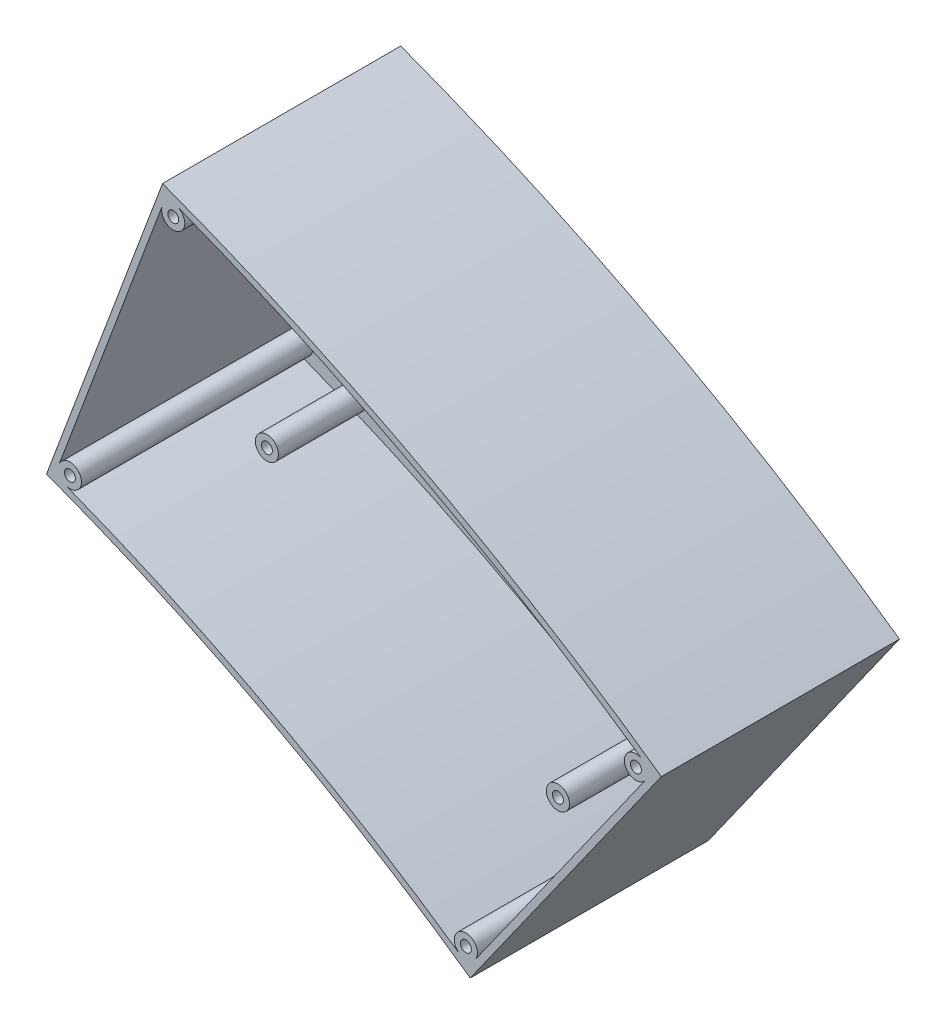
from build123d import *

# Parameters (mm, degrees)
BOSS_EXTRUDE1_DEPTH  = 2
EXTRUDE_THIN1_START  = 70
EXTRUDE_THIN1_DEPTH  = 70
SKETCH5_R            = 3.5
BOSS_EXTRUDE2_DEPTH  = 40
SKETCH6_R            = 1.65
CUT_EXTRUDE1_DEPTH   = 20
BOSS_EXTRUDE15_START = 70
BOSS_EXTRUDE15_DEPTH = 70
SKETCH9_R            = 1.65
CUT_EXTRUDE2_DEPTH   = 20
SKETCH10_R           = 3.2
CUT_EXTRUDE3_DEPTH   = 20
SKETCH11_W           = 20
SKETCH11_H           = 20
CUT_EXTRUDE4_DEPTH   = 20


with BuildPart() as part:
    # Sketch2 → Boss-Extrude1 (new body)
    with BuildSketch(Plane.XY):
        with BuildLine():
            Line((198.297374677, 529.05874078), (233.394255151, 622.697455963))
            ThreePointArc((233.394255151, 622.697455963), (311.368440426, 587.600795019), (384.194459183, 542.788741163))
            Line((384.194459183, 542.788741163), (326.420856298, 461.166374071))
            ThreePointArc((326.420856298, 461.166374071), (264.546118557, 499.239773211), (198.297374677, 529.05874078))
        make_face()
    extrude(amount=-BOSS_EXTRUDE1_DEPTH)

    # Sketch4 → Extrude-Thin1 (add)
    with BuildSketch(Plane.XY.offset(EXTRUDE_THIN1_START)):
        with BuildLine():
            Line((233.394255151, 622.697455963), (198.297374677, 529.05874078))
            ThreePointArc((198.297374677, 529.05874078), (264.546118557, 499.239773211), (326.420856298, 461.166374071))
            Line((326.420856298, 461.166374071), (384.194459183, 542.788741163))
            ThreePointArc((384.194459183, 542.788741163), (311.368440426, 587.600795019), (233.394255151, 622.697455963))
        make_face()
        with BuildLine():
            Line((234.564033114, 620.119919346), (200.870848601, 530.226274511))
            ThreePointArc((200.870848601, 530.226274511), (265.482564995, 501.006993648), (325.941843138, 463.951414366))
            Line((325.941843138, 463.951414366), (381.404796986, 542.30930366))
            ThreePointArc((381.404796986, 542.30930366), (310.431993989, 585.833574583), (234.564033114, 620.119919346))
        make_face(mode=Mode.SUBTRACT)
    extrude(amount=-EXTRUDE_THIN1_DEPTH)

    # Sketch5 → Boss-Extrude2 (add)
    with BuildSketch(Plane.XY):
        with Locations((234.930988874, 539.259390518)):
            Circle(SKETCH5_R)
        with Locations((258.693599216, 583.251871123)):
            Circle(SKETCH5_R)
        with Locations((346.678560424, 535.726650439)):
            Circle(SKETCH5_R)
        with Locations((322.915950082, 491.734169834)):
            Circle(SKETCH5_R)
    extrude(amount=BOSS_EXTRUDE2_DEPTH)

    # Sketch6 → Cut-Extrude1 (cut)
    with BuildSketch(Plane.XY.offset(40)):
        with Locations((346.678560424, 535.726650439)):
            Circle(SKETCH6_R)
        with Locations((322.915950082, 491.734169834)):
            Circle(SKETCH6_R)
        with Locations((234.930988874, 539.259390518)):
            Circle(SKETCH6_R)
        with Locations((258.693599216, 583.251871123)):
            Circle(SKETCH6_R)
    extrude(amount=-CUT_EXTRUDE1_DEPTH, mode=Mode.SUBTRACT)

    # Sketch8 → Boss-Extrude15 (add)
    with BuildSketch(Plane.XY.offset(BOSS_EXTRUDE15_START)):
        with BuildLine():
            Line((381.404796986, 542.30930366), (379.37121363, 539.436263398))
            ThreePointArc((379.37121363, 539.436263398), (373.067047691, 540.85373233), (378.512611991, 544.331886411))
            ThreePointArc((378.512611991, 544.331886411), (379.960050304, 543.322519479), (381.404796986, 542.30930366))
        make_face()
        with BuildLine():
            Line((234.564033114, 620.119919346), (233.328651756, 616.823913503))
            ThreePointArc((233.328651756, 616.823913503), (238.041545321, 612.403465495), (237.861686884, 618.862519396))
            ThreePointArc((237.861686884, 618.862519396), (236.213696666, 619.493413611), (234.564033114, 620.119919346))
        make_face()
        with BuildLine():
            Line((202.091172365, 533.48210659), (200.870848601, 530.226274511))
            ThreePointArc((200.870848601, 530.226274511), (202.490669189, 529.609789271), (204.10859778, 528.988355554))
            ThreePointArc((204.10859778, 528.988355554), (208.561517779, 533.687177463), (202.091172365, 533.48210659))
        make_face()
        with BuildLine():
            Line((327.950639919, 466.789436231), (325.941843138, 463.951414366))
            ThreePointArc((325.941843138, 463.951414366), (324.52214579, 464.945563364), (323.099416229, 465.935368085))
            ThreePointArc((323.099416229, 465.935368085), (324.48700739, 472.258501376), (327.950639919, 466.789436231))
        make_face()
    extrude(amount=-BOSS_EXTRUDE15_DEPTH)

    # Sketch9 → Cut-Extrude2 (cut)
    with BuildSketch(Plane.XY.offset(70)):
        with Locations((236.606006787, 615.595522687)):
            Circle(SKETCH9_R)
        with Locations((376.514430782, 541.458339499)):
            Circle(SKETCH9_R)
        with Locations((205.368527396, 532.253715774)):
            Circle(SKETCH9_R)
        with Locations((325.09385707, 468.811512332)):
            Circle(SKETCH9_R)
    extrude(amount=-CUT_EXTRUDE2_DEPTH, mode=Mode.SUBTRACT)

    # Sketch10 → Cut-Extrude3 (cut)
    with BuildSketch(Plane.XY):
        with Locations((326.244320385, 507.651110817)):
            Circle(SKETCH10_R)
        with Locations((237.442513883, 556.56832362)):
            Circle(SKETCH10_R)
    extrude(amount=-CUT_EXTRUDE3_DEPTH, mode=Mode.SUBTRACT)

    # Sketch11 → Cut-Extrude4 (cut)
    with BuildSketch(Plane.XY):
        with Locations((293.833830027, 543.411442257)):
            Rectangle(SKETCH11_W, SKETCH11_H)
    extrude(amount=-CUT_EXTRUDE4_DEPTH, mode=Mode.SUBTRACT)


solid = part.part
